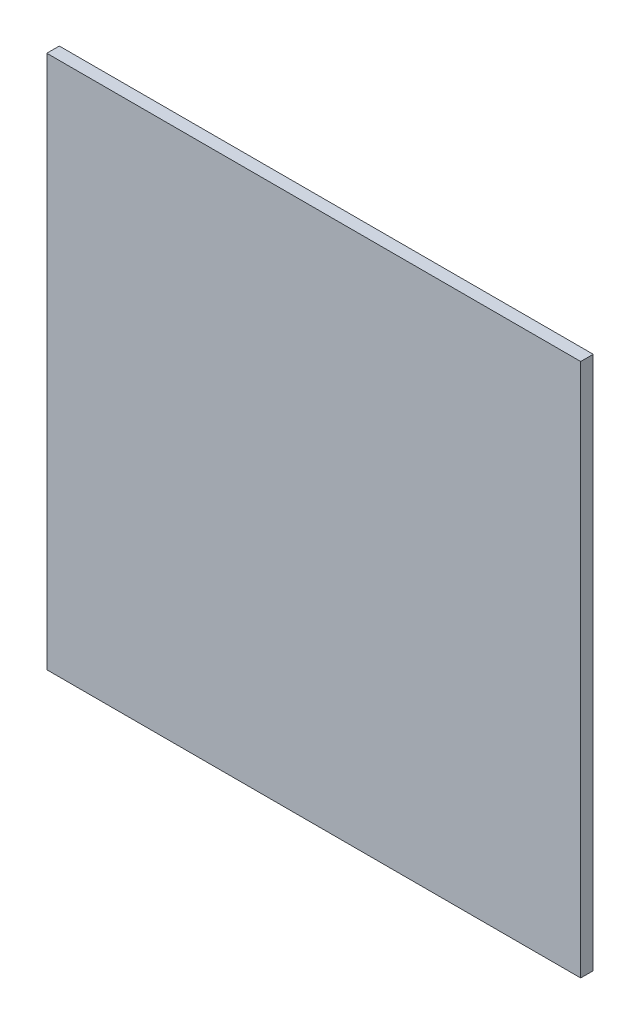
ISO-10303-21;
HEADER;
FILE_DESCRIPTION(('STEP AP214'),'2;1');
FILE_NAME('part.step','',(''),(''),'','','');
FILE_SCHEMA(('AUTOMOTIVE_DESIGN { 1 0 10303 214 1 1 1 1 }'));
ENDSEC;
DATA;
#1=APPLICATION_CONTEXT('core data for automotive mechanical design processes');
#2=APPLICATION_PROTOCOL_DEFINITION('international standard','automotive_design',2000,#1);
#3=PRODUCT_CONTEXT('',#1,'mechanical');
#4=PRODUCT('Part','Part','',(#3));
#5=PRODUCT_RELATED_PRODUCT_CATEGORY('part','',(#4));
#6=PRODUCT_DEFINITION_FORMATION('','',#4);
#7=PRODUCT_DEFINITION_CONTEXT('part definition',#1,'design');
#8=PRODUCT_DEFINITION('design','',#6,#7);
#9=PRODUCT_DEFINITION_SHAPE('','',#8);
#10=(LENGTH_UNIT() NAMED_UNIT(*) SI_UNIT(.MILLI.,.METRE.));
#11=(NAMED_UNIT(*) PLANE_ANGLE_UNIT() SI_UNIT($,.RADIAN.));
#12=(NAMED_UNIT(*) SI_UNIT($,.STERADIAN.) SOLID_ANGLE_UNIT());
#13=UNCERTAINTY_MEASURE_WITH_UNIT(LENGTH_MEASURE(1.E-05),#10,'distance_accuracy_value','');
#14=(GEOMETRIC_REPRESENTATION_CONTEXT(3) GLOBAL_UNCERTAINTY_ASSIGNED_CONTEXT((#13)) GLOBAL_UNIT_ASSIGNED_CONTEXT((#10,
#11,#12)) REPRESENTATION_CONTEXT('',''));
#15=CARTESIAN_POINT('',(0.,0.,0.));
#16=DIRECTION('',(0.,0.,1.));
#17=DIRECTION('',(1.,0.,0.));
#18=AXIS2_PLACEMENT_3D('',#15,#16,#17);
#19=CARTESIAN_POINT('',(0.,0.,9.525));
#20=DIRECTION('',(1.,0.,0.));
#21=DIRECTION('',(0.,1.,0.));
#22=AXIS2_PLACEMENT_3D('',#19,#20,#21);
#23=PLANE('',#22);
#24=DIRECTION('',(0.,-1.,0.));
#25=VECTOR('',#24,1.);
#26=CARTESIAN_POINT('',(0.,0.,0.));
#27=LINE('',#26,#25);
#28=CARTESIAN_POINT('',(0.,406.4,0.));
#29=VERTEX_POINT('',#28);
#30=CARTESIAN_POINT('',(0.,0.,0.));
#31=VERTEX_POINT('',#30);
#32=EDGE_CURVE('E72',#29,#31,#27,.T.);
#33=ORIENTED_EDGE('',*,*,#32,.T.);
#34=DIRECTION('',(0.,0.,-1.));
#35=VECTOR('',#34,1.);
#36=CARTESIAN_POINT('',(0.,0.,9.525));
#37=LINE('',#36,#35);
#38=CARTESIAN_POINT('',(0.,0.,9.525));
#39=VERTEX_POINT('',#38);
#40=EDGE_CURVE('E11',#39,#31,#37,.T.);
#41=ORIENTED_EDGE('',*,*,#40,.F.);
#42=DIRECTION('',(0.,-1.,0.));
#43=VECTOR('',#42,1.);
#44=CARTESIAN_POINT('',(0.,0.,9.525));
#45=LINE('',#44,#43);
#46=CARTESIAN_POINT('',(0.,406.4,9.525));
#47=VERTEX_POINT('',#46);
#48=EDGE_CURVE('E90',#47,#39,#45,.T.);
#49=ORIENTED_EDGE('',*,*,#48,.F.);
#50=DIRECTION('',(0.,0.,-1.));
#51=VECTOR('',#50,1.);
#52=CARTESIAN_POINT('',(0.,406.4,9.525));
#53=LINE('',#52,#51);
#54=EDGE_CURVE('E84',#47,#29,#53,.T.);
#55=ORIENTED_EDGE('',*,*,#54,.T.);
#56=EDGE_LOOP('',(#33,#41,#49,#55));
#57=FACE_BOUND('',#56,.T.);
#58=ADVANCED_FACE('F28',(#57),#23,.F.);
#59=CARTESIAN_POINT('',(0.,0.,9.525));
#60=DIRECTION('',(0.,1.,0.));
#61=DIRECTION('',(0.,0.,1.));
#62=AXIS2_PLACEMENT_3D('',#59,#60,#61);
#63=PLANE('',#62);
#64=DIRECTION('',(1.,0.,0.));
#65=VECTOR('',#64,1.);
#66=CARTESIAN_POINT('',(0.,0.,0.));
#67=LINE('',#66,#65);
#68=CARTESIAN_POINT('',(406.4,0.,0.));
#69=VERTEX_POINT('',#68);
#70=EDGE_CURVE('E68',#31,#69,#67,.T.);
#71=ORIENTED_EDGE('',*,*,#70,.T.);
#72=DIRECTION('',(0.,0.,-1.));
#73=VECTOR('',#72,1.);
#74=CARTESIAN_POINT('',(406.4,0.,9.525));
#75=LINE('',#74,#73);
#76=CARTESIAN_POINT('',(406.4,0.,9.525));
#77=VERTEX_POINT('',#76);
#78=EDGE_CURVE('E35',#77,#69,#75,.T.);
#79=ORIENTED_EDGE('',*,*,#78,.F.);
#80=DIRECTION('',(1.,0.,0.));
#81=VECTOR('',#80,1.);
#82=CARTESIAN_POINT('',(0.,0.,9.525));
#83=LINE('',#82,#81);
#84=EDGE_CURVE('E80',#39,#77,#83,.T.);
#85=ORIENTED_EDGE('',*,*,#84,.F.);
#86=ORIENTED_EDGE('',*,*,#40,.T.);
#87=EDGE_LOOP('',(#71,#79,#85,#86));
#88=FACE_BOUND('',#87,.T.);
#89=ADVANCED_FACE('F79',(#88),#63,.F.);
#90=CARTESIAN_POINT('',(406.4,0.,9.525));
#91=DIRECTION('',(-1.,0.,0.));
#92=DIRECTION('',(0.,-1.,0.));
#93=AXIS2_PLACEMENT_3D('',#90,#91,#92);
#94=PLANE('',#93);
#95=DIRECTION('',(0.,1.,0.));
#96=VECTOR('',#95,1.);
#97=CARTESIAN_POINT('',(406.4,0.,0.));
#98=LINE('',#97,#96);
#99=CARTESIAN_POINT('',(406.4,406.4,0.));
#100=VERTEX_POINT('',#99);
#101=EDGE_CURVE('E73',#69,#100,#98,.T.);
#102=ORIENTED_EDGE('',*,*,#101,.T.);
#103=DIRECTION('',(0.,0.,-1.));
#104=VECTOR('',#103,1.);
#105=CARTESIAN_POINT('',(406.4,406.4,9.525));
#106=LINE('',#105,#104);
#107=CARTESIAN_POINT('',(406.4,406.4,9.525));
#108=VERTEX_POINT('',#107);
#109=EDGE_CURVE('E96',#108,#100,#106,.T.);
#110=ORIENTED_EDGE('',*,*,#109,.F.);
#111=DIRECTION('',(0.,1.,0.));
#112=VECTOR('',#111,1.);
#113=CARTESIAN_POINT('',(406.4,0.,9.525));
#114=LINE('',#113,#112);
#115=EDGE_CURVE('E47',#77,#108,#114,.T.);
#116=ORIENTED_EDGE('',*,*,#115,.F.);
#117=ORIENTED_EDGE('',*,*,#78,.T.);
#118=EDGE_LOOP('',(#102,#110,#116,#117));
#119=FACE_BOUND('',#118,.T.);
#120=ADVANCED_FACE('F99',(#119),#94,.F.);
#121=CARTESIAN_POINT('',(0.,406.4,9.525));
#122=DIRECTION('',(0.,-1.,0.));
#123=DIRECTION('',(0.,0.,-1.));
#124=AXIS2_PLACEMENT_3D('',#121,#122,#123);
#125=PLANE('',#124);
#126=DIRECTION('',(-1.,0.,0.));
#127=VECTOR('',#126,1.);
#128=CARTESIAN_POINT('',(0.,406.4,0.));
#129=LINE('',#128,#127);
#130=EDGE_CURVE('E88',#100,#29,#129,.T.);
#131=ORIENTED_EDGE('',*,*,#130,.T.);
#132=ORIENTED_EDGE('',*,*,#54,.F.);
#133=DIRECTION('',(-1.,0.,0.));
#134=VECTOR('',#133,1.);
#135=CARTESIAN_POINT('',(0.,406.4,9.525));
#136=LINE('',#135,#134);
#137=EDGE_CURVE('E42',#108,#47,#136,.T.);
#138=ORIENTED_EDGE('',*,*,#137,.F.);
#139=ORIENTED_EDGE('',*,*,#109,.T.);
#140=EDGE_LOOP('',(#131,#132,#138,#139));
#141=FACE_BOUND('',#140,.T.);
#142=ADVANCED_FACE('F101',(#141),#125,.F.);
#143=CARTESIAN_POINT('',(0.,406.4,9.525));
#144=DIRECTION('',(0.,0.,-1.));
#145=DIRECTION('',(-1.,0.,0.));
#146=AXIS2_PLACEMENT_3D('',#143,#144,#145);
#147=PLANE('',#146);
#148=ORIENTED_EDGE('',*,*,#48,.T.);
#149=ORIENTED_EDGE('',*,*,#84,.T.);
#150=ORIENTED_EDGE('',*,*,#115,.T.);
#151=ORIENTED_EDGE('',*,*,#137,.T.);
#152=EDGE_LOOP('',(#148,#149,#150,#151));
#153=FACE_BOUND('',#152,.T.);
#154=ADVANCED_FACE('F102',(#153),#147,.F.);
#155=CARTESIAN_POINT('',(0.,406.4,0.));
#156=DIRECTION('',(0.,0.,-1.));
#157=DIRECTION('',(-1.,0.,0.));
#158=AXIS2_PLACEMENT_3D('',#155,#156,#157);
#159=PLANE('',#158);
#160=ORIENTED_EDGE('',*,*,#32,.F.);
#161=ORIENTED_EDGE('',*,*,#130,.F.);
#162=ORIENTED_EDGE('',*,*,#101,.F.);
#163=ORIENTED_EDGE('',*,*,#70,.F.);
#164=EDGE_LOOP('',(#160,#161,#162,#163));
#165=FACE_BOUND('',#164,.T.);
#166=ADVANCED_FACE('F69',(#165),#159,.T.);
#167=CLOSED_SHELL('',(#58,#89,#120,#142,#154,#166));
#168=MANIFOLD_SOLID_BREP('B2',#167);
#169=ADVANCED_BREP_SHAPE_REPRESENTATION('',(#18,#168),#14);
#170=SHAPE_DEFINITION_REPRESENTATION(#9,#169);
ENDSEC;
END-ISO-10303-21;
